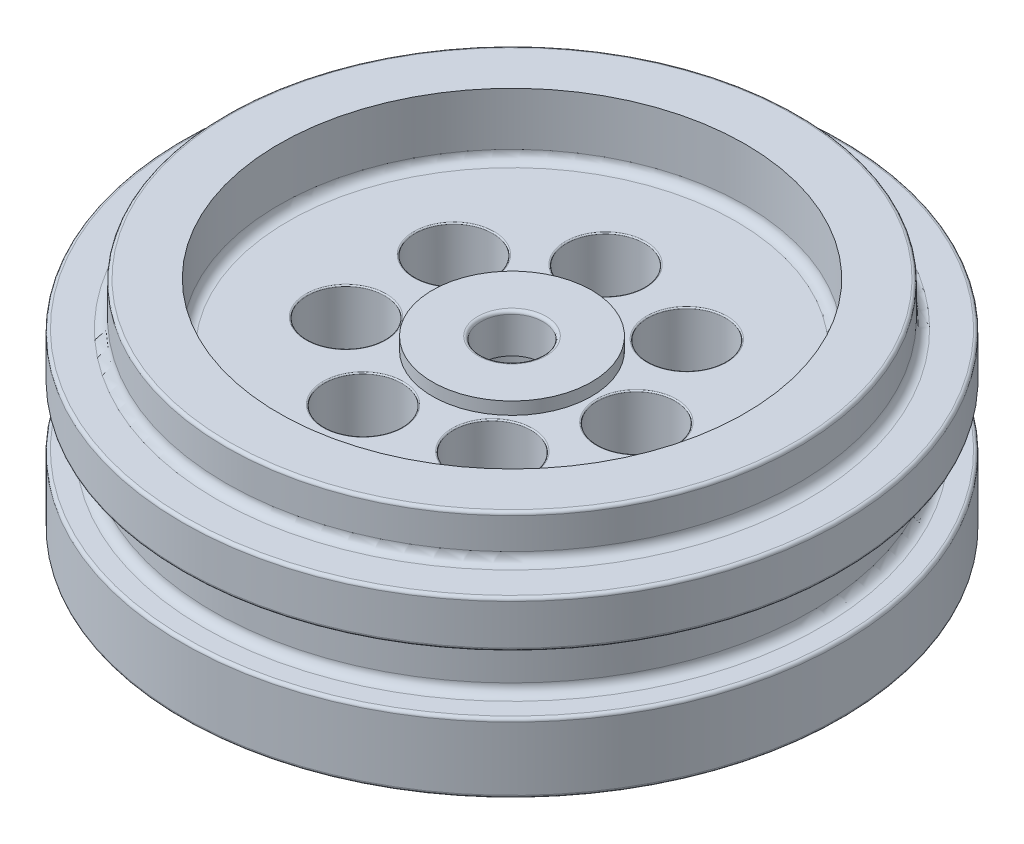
ISO-10303-21;
HEADER;
FILE_DESCRIPTION(('STEP AP214'),'2;1');
FILE_NAME('part.step','',(''),(''),'','','');
FILE_SCHEMA(('AUTOMOTIVE_DESIGN { 1 0 10303 214 1 1 1 1 }'));
ENDSEC;
DATA;
#1=APPLICATION_CONTEXT('core data for automotive mechanical design processes');
#2=APPLICATION_PROTOCOL_DEFINITION('international standard','automotive_design',2000,#1);
#3=PRODUCT_CONTEXT('',#1,'mechanical');
#4=PRODUCT('Part','Part','',(#3));
#5=PRODUCT_RELATED_PRODUCT_CATEGORY('part','',(#4));
#6=PRODUCT_DEFINITION_FORMATION('','',#4);
#7=PRODUCT_DEFINITION_CONTEXT('part definition',#1,'design');
#8=PRODUCT_DEFINITION('design','',#6,#7);
#9=PRODUCT_DEFINITION_SHAPE('','',#8);
#10=(LENGTH_UNIT() NAMED_UNIT(*) SI_UNIT(.MILLI.,.METRE.));
#11=(NAMED_UNIT(*) PLANE_ANGLE_UNIT() SI_UNIT($,.RADIAN.));
#12=(NAMED_UNIT(*) SI_UNIT($,.STERADIAN.) SOLID_ANGLE_UNIT());
#13=UNCERTAINTY_MEASURE_WITH_UNIT(LENGTH_MEASURE(1.E-05),#10,'distance_accuracy_value','');
#14=(GEOMETRIC_REPRESENTATION_CONTEXT(3) GLOBAL_UNCERTAINTY_ASSIGNED_CONTEXT((#13)) GLOBAL_UNIT_ASSIGNED_CONTEXT((#10,
#11,#12)) REPRESENTATION_CONTEXT('',''));
#15=CARTESIAN_POINT('',(0.,0.,0.));
#16=DIRECTION('',(0.,0.,1.));
#17=DIRECTION('',(1.,0.,0.));
#18=AXIS2_PLACEMENT_3D('',#15,#16,#17);
#19=CARTESIAN_POINT('',(0.,0.,0.));
#20=DIRECTION('',(0.,-1.,0.));
#21=DIRECTION('',(0.,0.,-1.));
#22=AXIS2_PLACEMENT_3D('',#19,#20,#21);
#23=CYLINDRICAL_SURFACE('',#22,13.462);
#24=CARTESIAN_POINT('',(0.,0.127,0.));
#25=DIRECTION('',(0.,-1.,0.));
#26=DIRECTION('',(0.,0.,-1.));
#27=AXIS2_PLACEMENT_3D('',#24,#25,#26);
#28=CIRCLE('',#27,13.462);
#29=CARTESIAN_POINT('',(0.,0.127,-13.462));
#30=VERTEX_POINT('',#29);
#31=EDGE_CURVE('E77',#30,#30,#28,.F.);
#32=ORIENTED_EDGE('',*,*,#31,.T.);
#33=EDGE_LOOP('',(#32));
#34=FACE_BOUND('',#33,.T.);
#35=CARTESIAN_POINT('',(0.,2.71527743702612,0.));
#36=DIRECTION('',(0.,-1.,0.));
#37=DIRECTION('',(0.,0.,-1.));
#38=AXIS2_PLACEMENT_3D('',#35,#36,#37);
#39=CIRCLE('',#38,13.462);
#40=CARTESIAN_POINT('',(0.,2.71527743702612,-13.462));
#41=VERTEX_POINT('',#40);
#42=EDGE_CURVE('E161',#41,#41,#39,.T.);
#43=ORIENTED_EDGE('',*,*,#42,.T.);
#44=EDGE_LOOP('',(#43));
#45=FACE_BOUND('',#44,.T.);
#46=ADVANCED_FACE('F50',(#34,#45),#23,.T.);
#47=CARTESIAN_POINT('',(0.,0.,0.));
#48=DIRECTION('',(0.,-1.,0.));
#49=DIRECTION('',(0.,0.,-1.));
#50=AXIS2_PLACEMENT_3D('',#47,#48,#49);
#51=PLANE('',#50);
#52=CARTESIAN_POINT('',(0.,0.,0.));
#53=DIRECTION('',(0.,-1.,0.));
#54=DIRECTION('',(0.,0.,-1.));
#55=AXIS2_PLACEMENT_3D('',#52,#53,#54);
#56=CIRCLE('',#55,9.5472661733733);
#57=CARTESIAN_POINT('',(0.,0.,-9.5472661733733));
#58=VERTEX_POINT('',#57);
#59=EDGE_CURVE('E201',#58,#58,#56,.T.);
#60=ORIENTED_EDGE('',*,*,#59,.T.);
#61=EDGE_LOOP('',(#60));
#62=FACE_BOUND('',#61,.T.);
#63=CARTESIAN_POINT('',(0.,0.,0.));
#64=DIRECTION('',(0.,1.,0.));
#65=DIRECTION('',(0.,0.,1.));
#66=AXIS2_PLACEMENT_3D('',#63,#64,#65);
#67=CIRCLE('',#66,6.985);
#68=CARTESIAN_POINT('',(0.,0.,6.985));
#69=VERTEX_POINT('',#68);
#70=EDGE_CURVE('E257',#69,#69,#67,.T.);
#71=ORIENTED_EDGE('',*,*,#70,.T.);
#72=EDGE_LOOP('',(#71));
#73=FACE_BOUND('',#72,.T.);
#74=ADVANCED_FACE('F321',(#62,#73),#51,.T.);
#75=CARTESIAN_POINT('',(0.,0.,0.));
#76=DIRECTION('',(0.,-1.,0.));
#77=DIRECTION('',(0.,0.,-1.));
#78=AXIS2_PLACEMENT_3D('',#75,#76,#77);
#79=CYLINDRICAL_SURFACE('',#78,11.684);
#80=CARTESIAN_POINT('',(0.,8.763,0.));
#81=DIRECTION('',(0.,1.,0.));
#82=DIRECTION('',(0.,0.,1.));
#83=AXIS2_PLACEMENT_3D('',#80,#81,#82);
#84=CIRCLE('',#83,11.684);
#85=CARTESIAN_POINT('',(0.,8.763,11.684));
#86=VERTEX_POINT('',#85);
#87=EDGE_CURVE('E71',#86,#86,#84,.F.);
#88=ORIENTED_EDGE('',*,*,#87,.T.);
#89=EDGE_LOOP('',(#88));
#90=FACE_BOUND('',#89,.T.);
#91=CARTESIAN_POINT('',(0.,7.493,0.));
#92=DIRECTION('',(0.,1.,0.));
#93=DIRECTION('',(0.,0.,1.));
#94=AXIS2_PLACEMENT_3D('',#91,#92,#93);
#95=CIRCLE('',#94,11.684);
#96=CARTESIAN_POINT('',(0.,7.493,11.684));
#97=VERTEX_POINT('',#96);
#98=EDGE_CURVE('E85',#97,#97,#95,.T.);
#99=ORIENTED_EDGE('',*,*,#98,.T.);
#100=EDGE_LOOP('',(#99));
#101=FACE_BOUND('',#100,.T.);
#102=ADVANCED_FACE('F329',(#90,#101),#79,.T.);
#103=CARTESIAN_POINT('',(11.684,8.89,0.));
#104=DIRECTION('',(0.,1.,0.));
#105=DIRECTION('',(0.,0.,1.));
#106=AXIS2_PLACEMENT_3D('',#103,#104,#105);
#107=PLANE('',#106);
#108=CARTESIAN_POINT('',(0.,8.89,0.));
#109=DIRECTION('',(0.,1.,0.));
#110=DIRECTION('',(0.,0.,1.));
#111=AXIS2_PLACEMENT_3D('',#108,#109,#110);
#112=CIRCLE('',#111,11.557);
#113=CARTESIAN_POINT('',(0.,8.89,11.557));
#114=VERTEX_POINT('',#113);
#115=EDGE_CURVE('E65',#114,#114,#112,.T.);
#116=ORIENTED_EDGE('',*,*,#115,.T.);
#117=EDGE_LOOP('',(#116));
#118=FACE_BOUND('',#117,.T.);
#119=CARTESIAN_POINT('',(0.,8.89,0.));
#120=DIRECTION('',(0.,-1.,0.));
#121=DIRECTION('',(0.,0.,-1.));
#122=AXIS2_PLACEMENT_3D('',#119,#120,#121);
#123=CIRCLE('',#122,9.525);
#124=CARTESIAN_POINT('',(0.,8.89,-9.525));
#125=VERTEX_POINT('',#124);
#126=EDGE_CURVE('E275',#125,#125,#123,.T.);
#127=ORIENTED_EDGE('',*,*,#126,.T.);
#128=EDGE_LOOP('',(#127));
#129=FACE_BOUND('',#128,.T.);
#130=ADVANCED_FACE('F338',(#118,#129),#107,.T.);
#131=CARTESIAN_POINT('',(0.,0.,0.));
#132=DIRECTION('',(0.,-1.,0.));
#133=DIRECTION('',(0.,0.,-1.));
#134=AXIS2_PLACEMENT_3D('',#131,#132,#133);
#135=CIRCLE('',#134,13.335);
#136=CARTESIAN_POINT('',(0.,0.,-13.335));
#137=VERTEX_POINT('',#136);
#138=EDGE_CURVE('E81',#137,#137,#135,.T.);
#139=ORIENTED_EDGE('',*,*,#138,.T.);
#140=EDGE_LOOP('',(#139));
#141=FACE_BOUND('',#140,.T.);
#142=CARTESIAN_POINT('',(0.,0.,0.));
#143=DIRECTION('',(0.,-1.,0.));
#144=DIRECTION('',(0.,0.,-1.));
#145=AXIS2_PLACEMENT_3D('',#142,#143,#144);
#146=CIRCLE('',#145,11.5208290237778);
#147=CARTESIAN_POINT('',(0.,0.,-11.5208290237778));
#148=VERTEX_POINT('',#147);
#149=EDGE_CURVE('E189',#148,#148,#146,.F.);
#150=ORIENTED_EDGE('',*,*,#149,.T.);
#151=EDGE_LOOP('',(#150));
#152=FACE_BOUND('',#151,.T.);
#153=ADVANCED_FACE('F332',(#141,#152),#51,.T.);
#154=CARTESIAN_POINT('',(0.,6.985,0.));
#155=DIRECTION('',(0.,1.,0.));
#156=DIRECTION('',(0.,0.,1.));
#157=AXIS2_PLACEMENT_3D('',#154,#155,#156);
#158=CIRCLE('',#157,13.462);
#159=CARTESIAN_POINT('',(0.,6.985,13.462));
#160=VERTEX_POINT('',#159);
#161=EDGE_CURVE('E58',#160,#160,#158,.F.);
#162=ORIENTED_EDGE('',*,*,#161,.T.);
#163=EDGE_LOOP('',(#162));
#164=FACE_BOUND('',#163,.T.);
#165=CARTESIAN_POINT('',(0.,5.33147743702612,0.));
#166=DIRECTION('',(0.,1.,0.));
#167=DIRECTION('',(0.,0.,1.));
#168=AXIS2_PLACEMENT_3D('',#165,#166,#167);
#169=CIRCLE('',#168,13.462);
#170=CARTESIAN_POINT('',(0.,5.33147743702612,13.462));
#171=VERTEX_POINT('',#170);
#172=EDGE_CURVE('E165',#171,#171,#169,.T.);
#173=ORIENTED_EDGE('',*,*,#172,.T.);
#174=EDGE_LOOP('',(#173));
#175=FACE_BOUND('',#174,.T.);
#176=ADVANCED_FACE('F317',(#164,#175),#23,.T.);
#177=CARTESIAN_POINT('',(13.462,7.112,0.));
#178=DIRECTION('',(0.,1.,0.));
#179=DIRECTION('',(0.,0.,1.));
#180=AXIS2_PLACEMENT_3D('',#177,#178,#179);
#181=PLANE('',#180);
#182=CARTESIAN_POINT('',(0.,7.112,0.));
#183=DIRECTION('',(0.,1.,0.));
#184=DIRECTION('',(0.,0.,1.));
#185=AXIS2_PLACEMENT_3D('',#182,#183,#184);
#186=CIRCLE('',#185,13.335);
#187=CARTESIAN_POINT('',(0.,7.112,13.335));
#188=VERTEX_POINT('',#187);
#189=EDGE_CURVE('E11',#188,#188,#186,.T.);
#190=ORIENTED_EDGE('',*,*,#189,.T.);
#191=EDGE_LOOP('',(#190));
#192=FACE_BOUND('',#191,.T.);
#193=CARTESIAN_POINT('',(0.,7.112,0.));
#194=DIRECTION('',(0.,1.,0.));
#195=DIRECTION('',(0.,0.,1.));
#196=AXIS2_PLACEMENT_3D('',#193,#194,#195);
#197=CIRCLE('',#196,12.065);
#198=CARTESIAN_POINT('',(0.,7.112,12.065));
#199=VERTEX_POINT('',#198);
#200=EDGE_CURVE('E89',#199,#199,#197,.F.);
#201=ORIENTED_EDGE('',*,*,#200,.T.);
#202=EDGE_LOOP('',(#201));
#203=FACE_BOUND('',#202,.T.);
#204=ADVANCED_FACE('F310',(#192,#203),#181,.T.);
#205=CARTESIAN_POINT('',(1.27,5.2578,0.));
#206=DIRECTION('',(0.,1.,0.));
#207=DIRECTION('',(0.,0.,1.));
#208=AXIS2_PLACEMENT_3D('',#205,#206,#207);
#209=PLANE('',#208);
#210=CARTESIAN_POINT('',(0.,5.2578,0.));
#211=DIRECTION('',(0.,-1.,0.));
#212=DIRECTION('',(0.,0.,-1.));
#213=AXIS2_PLACEMENT_3D('',#210,#211,#212);
#214=CIRCLE('',#213,1.27);
#215=CARTESIAN_POINT('',(0.,5.2578,-1.27));
#216=VERTEX_POINT('',#215);
#217=EDGE_CURVE('E267',#216,#216,#214,.T.);
#218=ORIENTED_EDGE('',*,*,#217,.F.);
#219=EDGE_LOOP('',(#218));
#220=FACE_BOUND('',#219,.T.);
#221=CARTESIAN_POINT('',(0.,5.2578,0.));
#222=DIRECTION('',(0.,-1.,0.));
#223=DIRECTION('',(0.,0.,-1.));
#224=AXIS2_PLACEMENT_3D('',#221,#222,#223);
#225=CIRCLE('',#224,2.159);
#226=CARTESIAN_POINT('',(0.,5.2578,-2.159));
#227=VERTEX_POINT('',#226);
#228=EDGE_CURVE('E228',#227,#227,#225,.T.);
#229=ORIENTED_EDGE('',*,*,#228,.T.);
#230=EDGE_LOOP('',(#229));
#231=FACE_BOUND('',#230,.T.);
#232=ADVANCED_FACE('F305',(#220,#231),#209,.F.);
#233=CARTESIAN_POINT('',(0.,0.,0.));
#234=DIRECTION('',(0.,-1.,0.));
#235=DIRECTION('',(0.,0.,-1.));
#236=AXIS2_PLACEMENT_3D('',#233,#234,#235);
#237=CYLINDRICAL_SURFACE('',#236,2.159);
#238=CARTESIAN_POINT('',(0.,2.54,0.));
#239=DIRECTION('',(0.,1.,0.));
#240=DIRECTION('',(0.,0.,1.));
#241=AXIS2_PLACEMENT_3D('',#238,#239,#240);
#242=CIRCLE('',#241,2.159);
#243=CARTESIAN_POINT('',(0.,2.54,2.159));
#244=VERTEX_POINT('',#243);
#245=EDGE_CURVE('E258',#244,#244,#242,.F.);
#246=ORIENTED_EDGE('',*,*,#245,.T.);
#247=EDGE_LOOP('',(#246));
#248=FACE_BOUND('',#247,.T.);
#249=ORIENTED_EDGE('',*,*,#228,.F.);
#250=EDGE_LOOP('',(#249));
#251=FACE_BOUND('',#250,.T.);
#252=ADVANCED_FACE('F301',(#248,#251),#237,.F.);
#253=CARTESIAN_POINT('',(1.27,6.858,0.));
#254=DIRECTION('',(0.,-1.,0.));
#255=DIRECTION('',(0.,0.,-1.));
#256=AXIS2_PLACEMENT_3D('',#253,#254,#255);
#257=PLANE('',#256);
#258=CARTESIAN_POINT('',(0.,6.858,0.));
#259=DIRECTION('',(0.,-1.,0.));
#260=DIRECTION('',(0.,0.,-1.));
#261=AXIS2_PLACEMENT_3D('',#258,#259,#260);
#262=CIRCLE('',#261,1.397);
#263=CARTESIAN_POINT('',(0.,6.858,-1.397));
#264=VERTEX_POINT('',#263);
#265=EDGE_CURVE('E225',#264,#264,#262,.T.);
#266=ORIENTED_EDGE('',*,*,#265,.T.);
#267=EDGE_LOOP('',(#266));
#268=FACE_BOUND('',#267,.T.);
#269=CARTESIAN_POINT('',(0.,6.858,0.));
#270=DIRECTION('',(0.,-1.,0.));
#271=DIRECTION('',(0.,0.,-1.));
#272=AXIS2_PLACEMENT_3D('',#269,#270,#271);
#273=CIRCLE('',#272,3.2512);
#274=CARTESIAN_POINT('',(0.,6.858,-3.2512));
#275=VERTEX_POINT('',#274);
#276=EDGE_CURVE('E271',#275,#275,#273,.F.);
#277=ORIENTED_EDGE('',*,*,#276,.T.);
#278=EDGE_LOOP('',(#277));
#279=FACE_BOUND('',#278,.T.);
#280=ADVANCED_FACE('F304',(#268,#279),#257,.F.);
#281=CARTESIAN_POINT('',(0.,0.,0.));
#282=DIRECTION('',(0.,-1.,0.));
#283=DIRECTION('',(0.,0.,-1.));
#284=AXIS2_PLACEMENT_3D('',#281,#282,#283);
#285=CYLINDRICAL_SURFACE('',#284,1.27);
#286=CARTESIAN_POINT('',(0.,6.731,0.));
#287=DIRECTION('',(0.,-1.,0.));
#288=DIRECTION('',(0.,0.,-1.));
#289=AXIS2_PLACEMENT_3D('',#286,#287,#288);
#290=CIRCLE('',#289,1.27);
#291=CARTESIAN_POINT('',(0.,6.731,-1.27));
#292=VERTEX_POINT('',#291);
#293=EDGE_CURVE('E221',#292,#292,#290,.F.);
#294=ORIENTED_EDGE('',*,*,#293,.T.);
#295=EDGE_LOOP('',(#294));
#296=FACE_BOUND('',#295,.T.);
#297=ORIENTED_EDGE('',*,*,#217,.T.);
#298=EDGE_LOOP('',(#297));
#299=FACE_BOUND('',#298,.T.);
#300=ADVANCED_FACE('F393',(#296,#299),#285,.F.);
#301=CARTESIAN_POINT('',(0.,0.,0.));
#302=DIRECTION('',(0.,-1.,0.));
#303=DIRECTION('',(0.,0.,-1.));
#304=AXIS2_PLACEMENT_3D('',#301,#302,#303);
#305=CYLINDRICAL_SURFACE('',#304,3.2512);
#306=CARTESIAN_POINT('',(0.,6.35,0.));
#307=DIRECTION('',(0.,-1.,0.));
#308=DIRECTION('',(0.,0.,-1.));
#309=AXIS2_PLACEMENT_3D('',#306,#307,#308);
#310=CIRCLE('',#309,3.2512);
#311=CARTESIAN_POINT('',(0.,6.35,-3.2512));
#312=VERTEX_POINT('',#311);
#313=EDGE_CURVE('E262',#312,#312,#310,.T.);
#314=ORIENTED_EDGE('',*,*,#313,.F.);
#315=EDGE_LOOP('',(#314));
#316=FACE_BOUND('',#315,.T.);
#317=ORIENTED_EDGE('',*,*,#276,.F.);
#318=EDGE_LOOP('',(#317));
#319=FACE_BOUND('',#318,.T.);
#320=ADVANCED_FACE('F390',(#316,#319),#305,.T.);
#321=CARTESIAN_POINT('',(3.2512,6.35,0.));
#322=DIRECTION('',(0.,-1.,0.));
#323=DIRECTION('',(0.,0.,-1.));
#324=AXIS2_PLACEMENT_3D('',#321,#322,#323);
#325=PLANE('',#324);
#326=CARTESIAN_POINT('',(0.,6.35,0.));
#327=DIRECTION('',(0.,-1.,0.));
#328=DIRECTION('',(0.,0.,-1.));
#329=AXIS2_PLACEMENT_3D('',#326,#327,#328);
#330=CIRCLE('',#329,9.144);
#331=CARTESIAN_POINT('',(0.,6.35,-9.144));
#332=VERTEX_POINT('',#331);
#333=EDGE_CURVE('E93',#332,#332,#330,.F.);
#334=ORIENTED_EDGE('',*,*,#333,.T.);
#335=EDGE_LOOP('',(#334));
#336=FACE_BOUND('',#335,.T.);
#337=CARTESIAN_POINT('',(5.08,6.35,0.));
#338=DIRECTION('',(0.,-1.,0.));
#339=DIRECTION('',(0.,0.,-1.));
#340=AXIS2_PLACEMENT_3D('',#337,#338,#339);
#341=CIRCLE('',#340,1.6383);
#342=CARTESIAN_POINT('',(5.08,6.35,-1.6383));
#343=VERTEX_POINT('',#342);
#344=EDGE_CURVE('E129',#343,#343,#341,.T.);
#345=ORIENTED_EDGE('',*,*,#344,.T.);
#346=EDGE_LOOP('',(#345));
#347=FACE_BOUND('',#346,.T.);
#348=CARTESIAN_POINT('',(3.16732819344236,6.35,3.9717039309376));
#349=DIRECTION('',(0.,-1.,0.));
#350=DIRECTION('',(0.,0.,-1.));
#351=AXIS2_PLACEMENT_3D('',#348,#349,#350);
#352=CIRCLE('',#351,1.6383);
#353=CARTESIAN_POINT('',(3.16732819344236,6.35,2.3334039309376));
#354=VERTEX_POINT('',#353);
#355=EDGE_CURVE('E133',#354,#354,#352,.T.);
#356=ORIENTED_EDGE('',*,*,#355,.T.);
#357=EDGE_LOOP('',(#356));
#358=FACE_BOUND('',#357,.T.);
#359=CARTESIAN_POINT('',(-1.1304063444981,6.35,4.95263379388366));
#360=DIRECTION('',(0.,-1.,0.));
#361=DIRECTION('',(0.,0.,-1.));
#362=AXIS2_PLACEMENT_3D('',#359,#360,#361);
#363=CIRCLE('',#362,1.6383);
#364=CARTESIAN_POINT('',(-1.1304063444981,6.35,3.31433379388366));
#365=VERTEX_POINT('',#364);
#366=EDGE_CURVE('E137',#365,#365,#363,.T.);
#367=ORIENTED_EDGE('',*,*,#366,.T.);
#368=EDGE_LOOP('',(#367));
#369=FACE_BOUND('',#368,.T.);
#370=CARTESIAN_POINT('',(-4.5769218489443,6.35,2.20412939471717));
#371=DIRECTION('',(0.,-1.,0.));
#372=DIRECTION('',(0.,0.,-1.));
#373=AXIS2_PLACEMENT_3D('',#370,#371,#372);
#374=CIRCLE('',#373,1.6383);
#375=CARTESIAN_POINT('',(-4.5769218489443,6.35,0.565829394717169));
#376=VERTEX_POINT('',#375);
#377=EDGE_CURVE('E141',#376,#376,#374,.T.);
#378=ORIENTED_EDGE('',*,*,#377,.T.);
#379=EDGE_LOOP('',(#378));
#380=FACE_BOUND('',#379,.T.);
#381=CARTESIAN_POINT('',(-4.57692184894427,6.35,-2.20412939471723));
#382=DIRECTION('',(0.,-1.,0.));
#383=DIRECTION('',(0.,0.,-1.));
#384=AXIS2_PLACEMENT_3D('',#381,#382,#383);
#385=CIRCLE('',#384,1.6383);
#386=CARTESIAN_POINT('',(-4.57692184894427,6.35,-3.84242939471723));
#387=VERTEX_POINT('',#386);
#388=EDGE_CURVE('E145',#387,#387,#385,.T.);
#389=ORIENTED_EDGE('',*,*,#388,.T.);
#390=EDGE_LOOP('',(#389));
#391=FACE_BOUND('',#390,.T.);
#392=CARTESIAN_POINT('',(-1.13040634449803,6.35,-4.95263379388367));
#393=DIRECTION('',(0.,-1.,0.));
#394=DIRECTION('',(0.,0.,-1.));
#395=AXIS2_PLACEMENT_3D('',#392,#393,#394);
#396=CIRCLE('',#395,1.6383);
#397=CARTESIAN_POINT('',(-1.13040634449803,6.35,-6.59093379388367));
#398=VERTEX_POINT('',#397);
#399=EDGE_CURVE('E149',#398,#398,#396,.T.);
#400=ORIENTED_EDGE('',*,*,#399,.T.);
#401=EDGE_LOOP('',(#400));
#402=FACE_BOUND('',#401,.T.);
#403=CARTESIAN_POINT('',(3.16732819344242,6.35,-3.97170393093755));
#404=DIRECTION('',(0.,-1.,0.));
#405=DIRECTION('',(0.,0.,-1.));
#406=AXIS2_PLACEMENT_3D('',#403,#404,#405);
#407=CIRCLE('',#406,1.6383);
#408=CARTESIAN_POINT('',(3.16732819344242,6.35,-5.61000393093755));
#409=VERTEX_POINT('',#408);
#410=EDGE_CURVE('E153',#409,#409,#407,.T.);
#411=ORIENTED_EDGE('',*,*,#410,.T.);
#412=EDGE_LOOP('',(#411));
#413=FACE_BOUND('',#412,.T.);
#414=ORIENTED_EDGE('',*,*,#313,.T.);
#415=EDGE_LOOP('',(#414));
#416=FACE_BOUND('',#415,.T.);
#417=ADVANCED_FACE('F392',(#336,#347,#358,#369,#380,#391,#402,#413,#416),#325,.F.);
#418=CARTESIAN_POINT('',(0.,0.,0.));
#419=DIRECTION('',(0.,-1.,0.));
#420=DIRECTION('',(0.,0.,-1.));
#421=AXIS2_PLACEMENT_3D('',#418,#419,#420);
#422=CYLINDRICAL_SURFACE('',#421,9.525);
#423=CARTESIAN_POINT('',(0.,6.731,0.));
#424=DIRECTION('',(0.,-1.,0.));
#425=DIRECTION('',(0.,0.,-1.));
#426=AXIS2_PLACEMENT_3D('',#423,#424,#425);
#427=CIRCLE('',#426,9.525);
#428=CARTESIAN_POINT('',(0.,6.731,-9.525));
#429=VERTEX_POINT('',#428);
#430=EDGE_CURVE('E97',#429,#429,#427,.T.);
#431=ORIENTED_EDGE('',*,*,#430,.T.);
#432=EDGE_LOOP('',(#431));
#433=FACE_BOUND('',#432,.T.);
#434=ORIENTED_EDGE('',*,*,#126,.F.);
#435=EDGE_LOOP('',(#434));
#436=FACE_BOUND('',#435,.T.);
#437=ADVANCED_FACE('F395',(#433,#436),#422,.F.);
#438=CARTESIAN_POINT('',(0.,1.3208,0.));
#439=DIRECTION('',(0.,-1.,0.));
#440=DIRECTION('',(0.,0.,-1.));
#441=AXIS2_PLACEMENT_3D('',#438,#439,#440);
#442=CONICAL_SURFACE('',#441,9.15477097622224,0.41887902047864);
#443=CARTESIAN_POINT('',(0.,0.178655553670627,0.));
#444=DIRECTION('',(0.,-1.,0.));
#445=DIRECTION('',(0.,0.,-1.));
#446=AXIS2_PLACEMENT_3D('',#443,#444,#445);
#447=CIRCLE('',#446,9.66328644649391);
#448=CARTESIAN_POINT('',(0.,0.178655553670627,-9.66328644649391));
#449=VERTEX_POINT('',#448);
#450=EDGE_CURVE('E197',#449,#449,#447,.F.);
#451=ORIENTED_EDGE('',*,*,#450,.T.);
#452=EDGE_LOOP('',(#451));
#453=FACE_BOUND('',#452,.T.);
#454=CARTESIAN_POINT('',(0.,0.784833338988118,0.));
#455=DIRECTION('',(0.,-1.,0.));
#456=DIRECTION('',(0.,0.,-1.));
#457=AXIS2_PLACEMENT_3D('',#454,#455,#456);
#458=CIRCLE('',#457,9.39339870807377);
#459=CARTESIAN_POINT('',(0.,0.784833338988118,-9.39339870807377));
#460=VERTEX_POINT('',#459);
#461=EDGE_CURVE('E217',#460,#460,#458,.T.);
#462=ORIENTED_EDGE('',*,*,#461,.T.);
#463=EDGE_LOOP('',(#462));
#464=FACE_BOUND('',#463,.T.);
#465=ADVANCED_FACE('F388',(#453,#464),#442,.T.);
#466=CARTESIAN_POINT('',(11.3938290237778,1.3208,0.));
#467=DIRECTION('',(0.,1.,0.));
#468=DIRECTION('',(0.,0.,1.));
#469=AXIS2_PLACEMENT_3D('',#466,#467,#468);
#470=PLANE('',#469);
#471=CARTESIAN_POINT('',(0.,1.3208,0.));
#472=DIRECTION('',(0.,1.,0.));
#473=DIRECTION('',(0.,0.,1.));
#474=AXIS2_PLACEMENT_3D('',#471,#472,#473);
#475=CIRCLE('',#474,9.7414595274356);
#476=CARTESIAN_POINT('',(0.,1.3208,9.7414595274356));
#477=VERTEX_POINT('',#476);
#478=EDGE_CURVE('E209',#477,#477,#475,.T.);
#479=ORIENTED_EDGE('',*,*,#478,.T.);
#480=EDGE_LOOP('',(#479));
#481=FACE_BOUND('',#480,.T.);
#482=CARTESIAN_POINT('',(0.,1.3208,0.));
#483=DIRECTION('',(0.,1.,0.));
#484=DIRECTION('',(0.,0.,1.));
#485=AXIS2_PLACEMENT_3D('',#482,#483,#484);
#486=CIRCLE('',#485,11.0128290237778);
#487=CARTESIAN_POINT('',(0.,1.3208,11.0128290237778));
#488=VERTEX_POINT('',#487);
#489=EDGE_CURVE('E213',#488,#488,#486,.F.);
#490=ORIENTED_EDGE('',*,*,#489,.T.);
#491=EDGE_LOOP('',(#490));
#492=FACE_BOUND('',#491,.T.);
#493=ADVANCED_FACE('F382',(#481,#492),#470,.F.);
#494=CARTESIAN_POINT('',(0.,0.,0.));
#495=DIRECTION('',(0.,-1.,0.));
#496=DIRECTION('',(0.,0.,-1.));
#497=AXIS2_PLACEMENT_3D('',#494,#495,#496);
#498=CYLINDRICAL_SURFACE('',#497,11.3938290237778);
#499=CARTESIAN_POINT('',(0.,0.127,0.));
#500=DIRECTION('',(0.,-1.,0.));
#501=DIRECTION('',(0.,0.,-1.));
#502=AXIS2_PLACEMENT_3D('',#499,#500,#501);
#503=CIRCLE('',#502,11.3938290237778);
#504=CARTESIAN_POINT('',(0.,0.127,-11.3938290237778));
#505=VERTEX_POINT('',#504);
#506=EDGE_CURVE('E193',#505,#505,#503,.T.);
#507=ORIENTED_EDGE('',*,*,#506,.T.);
#508=EDGE_LOOP('',(#507));
#509=FACE_BOUND('',#508,.T.);
#510=CARTESIAN_POINT('',(0.,0.9398,0.));
#511=DIRECTION('',(0.,1.,0.));
#512=DIRECTION('',(0.,0.,1.));
#513=AXIS2_PLACEMENT_3D('',#510,#511,#512);
#514=CIRCLE('',#513,11.3938290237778);
#515=CARTESIAN_POINT('',(0.,0.9398,11.3938290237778));
#516=VERTEX_POINT('',#515);
#517=EDGE_CURVE('E205',#516,#516,#514,.T.);
#518=ORIENTED_EDGE('',*,*,#517,.T.);
#519=EDGE_LOOP('',(#518));
#520=FACE_BOUND('',#519,.T.);
#521=ADVANCED_FACE('F376',(#509,#520),#498,.F.);
#522=CARTESIAN_POINT('',(13.462,2.84227743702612,0.));
#523=DIRECTION('',(0.,-1.,0.));
#524=DIRECTION('',(0.,0.,-1.));
#525=AXIS2_PLACEMENT_3D('',#522,#523,#524);
#526=PLANE('',#525);
#527=CARTESIAN_POINT('',(0.,2.84227743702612,0.));
#528=DIRECTION('',(0.,-1.,0.));
#529=DIRECTION('',(0.,0.,-1.));
#530=AXIS2_PLACEMENT_3D('',#527,#528,#529);
#531=CIRCLE('',#530,13.335);
#532=CARTESIAN_POINT('',(0.,2.84227743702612,-13.335));
#533=VERTEX_POINT('',#532);
#534=EDGE_CURVE('E157',#533,#533,#531,.F.);
#535=ORIENTED_EDGE('',*,*,#534,.T.);
#536=EDGE_LOOP('',(#535));
#537=FACE_BOUND('',#536,.T.);
#538=CARTESIAN_POINT('',(0.,2.84227743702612,0.));
#539=DIRECTION('',(0.,-1.,0.));
#540=DIRECTION('',(0.,0.,-1.));
#541=AXIS2_PLACEMENT_3D('',#538,#539,#540);
#542=CIRCLE('',#541,12.5984);
#543=CARTESIAN_POINT('',(0.,2.84227743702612,-12.5984));
#544=VERTEX_POINT('',#543);
#545=EDGE_CURVE('E173',#544,#544,#542,.T.);
#546=ORIENTED_EDGE('',*,*,#545,.T.);
#547=EDGE_LOOP('',(#546));
#548=FACE_BOUND('',#547,.T.);
#549=ADVANCED_FACE('F366',(#537,#548),#526,.F.);
#550=CARTESIAN_POINT('',(0.,0.,0.));
#551=DIRECTION('',(0.,-1.,0.));
#552=DIRECTION('',(0.,0.,-1.));
#553=AXIS2_PLACEMENT_3D('',#550,#551,#552);
#554=CYLINDRICAL_SURFACE('',#553,12.2174);
#555=CARTESIAN_POINT('',(0.,4.82347743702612,0.));
#556=DIRECTION('',(0.,1.,0.));
#557=DIRECTION('',(0.,0.,1.));
#558=AXIS2_PLACEMENT_3D('',#555,#556,#557);
#559=CIRCLE('',#558,12.2174);
#560=CARTESIAN_POINT('',(0.,4.82347743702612,12.2174));
#561=VERTEX_POINT('',#560);
#562=EDGE_CURVE('E181',#561,#561,#559,.F.);
#563=ORIENTED_EDGE('',*,*,#562,.T.);
#564=EDGE_LOOP('',(#563));
#565=FACE_BOUND('',#564,.T.);
#566=CARTESIAN_POINT('',(0.,3.22327743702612,0.));
#567=DIRECTION('',(0.,-1.,0.));
#568=DIRECTION('',(0.,0.,-1.));
#569=AXIS2_PLACEMENT_3D('',#566,#567,#568);
#570=CIRCLE('',#569,12.2174);
#571=CARTESIAN_POINT('',(0.,3.22327743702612,-12.2174));
#572=VERTEX_POINT('',#571);
#573=EDGE_CURVE('E185',#572,#572,#570,.F.);
#574=ORIENTED_EDGE('',*,*,#573,.T.);
#575=EDGE_LOOP('',(#574));
#576=FACE_BOUND('',#575,.T.);
#577=ADVANCED_FACE('F353',(#565,#576),#554,.T.);
#578=CARTESIAN_POINT('',(13.462,5.20447743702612,0.));
#579=DIRECTION('',(0.,1.,0.));
#580=DIRECTION('',(0.,0.,1.));
#581=AXIS2_PLACEMENT_3D('',#578,#579,#580);
#582=PLANE('',#581);
#583=CARTESIAN_POINT('',(0.,5.20447743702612,0.));
#584=DIRECTION('',(0.,1.,0.));
#585=DIRECTION('',(0.,0.,1.));
#586=AXIS2_PLACEMENT_3D('',#583,#584,#585);
#587=CIRCLE('',#586,13.335);
#588=CARTESIAN_POINT('',(0.,5.20447743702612,13.335));
#589=VERTEX_POINT('',#588);
#590=EDGE_CURVE('E169',#589,#589,#587,.F.);
#591=ORIENTED_EDGE('',*,*,#590,.T.);
#592=EDGE_LOOP('',(#591));
#593=FACE_BOUND('',#592,.T.);
#594=CARTESIAN_POINT('',(0.,5.20447743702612,0.));
#595=DIRECTION('',(0.,1.,0.));
#596=DIRECTION('',(0.,0.,1.));
#597=AXIS2_PLACEMENT_3D('',#594,#595,#596);
#598=CIRCLE('',#597,12.5984);
#599=CARTESIAN_POINT('',(0.,5.20447743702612,12.5984));
#600=VERTEX_POINT('',#599);
#601=EDGE_CURVE('E177',#600,#600,#598,.T.);
#602=ORIENTED_EDGE('',*,*,#601,.T.);
#603=EDGE_LOOP('',(#602));
#604=FACE_BOUND('',#603,.T.);
#605=ADVANCED_FACE('F296',(#593,#604),#582,.F.);
#606=CARTESIAN_POINT('',(0.,2.54,0.));
#607=DIRECTION('',(0.,1.,0.));
#608=DIRECTION('',(0.,0.,1.));
#609=AXIS2_PLACEMENT_3D('',#606,#607,#608);
#610=PLANE('',#609);
#611=CARTESIAN_POINT('',(3.16732819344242,2.54,-3.97170393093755));
#612=DIRECTION('',(0.,1.,0.));
#613=DIRECTION('',(0.,0.,1.));
#614=AXIS2_PLACEMENT_3D('',#611,#612,#613);
#615=CIRCLE('',#614,1.5875);
#616=CARTESIAN_POINT('',(3.16732819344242,2.54,-2.38420393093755));
#617=VERTEX_POINT('',#616);
#618=EDGE_CURVE('E229',#617,#617,#615,.T.);
#619=ORIENTED_EDGE('',*,*,#618,.T.);
#620=EDGE_LOOP('',(#619));
#621=FACE_BOUND('',#620,.T.);
#622=CARTESIAN_POINT('',(-1.13040634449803,2.54,-4.95263379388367));
#623=DIRECTION('',(0.,1.,0.));
#624=DIRECTION('',(0.,0.,1.));
#625=AXIS2_PLACEMENT_3D('',#622,#623,#624);
#626=CIRCLE('',#625,1.5875);
#627=CARTESIAN_POINT('',(-1.13040634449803,2.54,-3.36513379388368));
#628=VERTEX_POINT('',#627);
#629=EDGE_CURVE('E233',#628,#628,#626,.T.);
#630=ORIENTED_EDGE('',*,*,#629,.T.);
#631=EDGE_LOOP('',(#630));
#632=FACE_BOUND('',#631,.T.);
#633=CARTESIAN_POINT('',(-4.57692184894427,2.54,-2.20412939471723));
#634=DIRECTION('',(0.,1.,0.));
#635=DIRECTION('',(0.,0.,1.));
#636=AXIS2_PLACEMENT_3D('',#633,#634,#635);
#637=CIRCLE('',#636,1.5875);
#638=CARTESIAN_POINT('',(-4.57692184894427,2.54,-0.616629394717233));
#639=VERTEX_POINT('',#638);
#640=EDGE_CURVE('E237',#639,#639,#637,.T.);
#641=ORIENTED_EDGE('',*,*,#640,.T.);
#642=EDGE_LOOP('',(#641));
#643=FACE_BOUND('',#642,.T.);
#644=CARTESIAN_POINT('',(-4.5769218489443,2.54,2.20412939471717));
#645=DIRECTION('',(0.,1.,0.));
#646=DIRECTION('',(0.,0.,1.));
#647=AXIS2_PLACEMENT_3D('',#644,#645,#646);
#648=CIRCLE('',#647,1.5875);
#649=CARTESIAN_POINT('',(-4.5769218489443,2.54,3.79162939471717));
#650=VERTEX_POINT('',#649);
#651=EDGE_CURVE('E241',#650,#650,#648,.T.);
#652=ORIENTED_EDGE('',*,*,#651,.T.);
#653=EDGE_LOOP('',(#652));
#654=FACE_BOUND('',#653,.T.);
#655=CARTESIAN_POINT('',(-1.1304063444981,2.54,4.95263379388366));
#656=DIRECTION('',(0.,1.,0.));
#657=DIRECTION('',(0.,0.,1.));
#658=AXIS2_PLACEMENT_3D('',#655,#656,#657);
#659=CIRCLE('',#658,1.5875);
#660=CARTESIAN_POINT('',(-1.1304063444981,2.54,6.54013379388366));
#661=VERTEX_POINT('',#660);
#662=EDGE_CURVE('E245',#661,#661,#659,.T.);
#663=ORIENTED_EDGE('',*,*,#662,.T.);
#664=EDGE_LOOP('',(#663));
#665=FACE_BOUND('',#664,.T.);
#666=CARTESIAN_POINT('',(3.16732819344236,2.54,3.9717039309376));
#667=DIRECTION('',(0.,1.,0.));
#668=DIRECTION('',(0.,0.,1.));
#669=AXIS2_PLACEMENT_3D('',#666,#667,#668);
#670=CIRCLE('',#669,1.5875);
#671=CARTESIAN_POINT('',(3.16732819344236,2.54,5.5592039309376));
#672=VERTEX_POINT('',#671);
#673=EDGE_CURVE('E249',#672,#672,#670,.T.);
#674=ORIENTED_EDGE('',*,*,#673,.T.);
#675=EDGE_LOOP('',(#674));
#676=FACE_BOUND('',#675,.T.);
#677=CARTESIAN_POINT('',(5.08,2.54,0.));
#678=DIRECTION('',(0.,1.,0.));
#679=DIRECTION('',(0.,0.,1.));
#680=AXIS2_PLACEMENT_3D('',#677,#678,#679);
#681=CIRCLE('',#680,1.5875);
#682=CARTESIAN_POINT('',(5.08,2.54,1.5875));
#683=VERTEX_POINT('',#682);
#684=EDGE_CURVE('E253',#683,#683,#681,.T.);
#685=ORIENTED_EDGE('',*,*,#684,.T.);
#686=EDGE_LOOP('',(#685));
#687=FACE_BOUND('',#686,.T.);
#688=CARTESIAN_POINT('',(0.,2.54,0.));
#689=DIRECTION('',(0.,1.,0.));
#690=DIRECTION('',(0.,0.,1.));
#691=AXIS2_PLACEMENT_3D('',#688,#689,#690);
#692=CIRCLE('',#691,6.985);
#693=CARTESIAN_POINT('',(0.,2.54,6.985));
#694=VERTEX_POINT('',#693);
#695=EDGE_CURVE('E263',#694,#694,#692,.T.);
#696=ORIENTED_EDGE('',*,*,#695,.F.);
#697=EDGE_LOOP('',(#696));
#698=FACE_BOUND('',#697,.T.);
#699=ORIENTED_EDGE('',*,*,#245,.F.);
#700=EDGE_LOOP('',(#699));
#701=FACE_BOUND('',#700,.T.);
#702=ADVANCED_FACE('F293',(#621,#632,#643,#654,#665,#676,#687,#698,#701),#610,.F.);
#703=CARTESIAN_POINT('',(0.,2.54,0.));
#704=DIRECTION('',(0.,-1.,0.));
#705=DIRECTION('',(0.,0.,-1.));
#706=AXIS2_PLACEMENT_3D('',#703,#704,#705);
#707=CYLINDRICAL_SURFACE('',#706,6.985);
#708=ORIENTED_EDGE('',*,*,#695,.T.);
#709=EDGE_LOOP('',(#708));
#710=FACE_BOUND('',#709,.T.);
#711=ORIENTED_EDGE('',*,*,#70,.F.);
#712=EDGE_LOOP('',(#711));
#713=FACE_BOUND('',#712,.T.);
#714=ADVANCED_FACE('F290',(#710,#713),#707,.F.);
#715=CARTESIAN_POINT('',(5.08,0.,0.));
#716=DIRECTION('',(0.,-1.,0.));
#717=DIRECTION('',(0.,0.,-1.));
#718=AXIS2_PLACEMENT_3D('',#715,#716,#717);
#719=CYLINDRICAL_SURFACE('',#718,1.5875);
#720=CARTESIAN_POINT('',(5.08,6.2992,0.));
#721=DIRECTION('',(0.,-1.,0.));
#722=DIRECTION('',(0.,0.,-1.));
#723=AXIS2_PLACEMENT_3D('',#720,#721,#722);
#724=CIRCLE('',#723,1.5875);
#725=CARTESIAN_POINT('',(5.08,6.2992,-1.5875));
#726=VERTEX_POINT('',#725);
#727=EDGE_CURVE('E125',#726,#726,#724,.F.);
#728=ORIENTED_EDGE('',*,*,#727,.T.);
#729=EDGE_LOOP('',(#728));
#730=FACE_BOUND('',#729,.T.);
#731=ORIENTED_EDGE('',*,*,#684,.F.);
#732=EDGE_LOOP('',(#731));
#733=FACE_BOUND('',#732,.T.);
#734=ADVANCED_FACE('F625',(#730,#733),#719,.F.);
#735=CARTESIAN_POINT('',(3.16732819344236,0.,3.9717039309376));
#736=DIRECTION('',(0.,-1.,0.));
#737=DIRECTION('',(0.,0.,-1.));
#738=AXIS2_PLACEMENT_3D('',#735,#736,#737);
#739=CYLINDRICAL_SURFACE('',#738,1.5875);
#740=CARTESIAN_POINT('',(3.16732819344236,6.2992,3.9717039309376));
#741=DIRECTION('',(0.,-1.,0.));
#742=DIRECTION('',(0.,0.,-1.));
#743=AXIS2_PLACEMENT_3D('',#740,#741,#742);
#744=CIRCLE('',#743,1.5875);
#745=CARTESIAN_POINT('',(3.16732819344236,6.2992,2.3842039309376));
#746=VERTEX_POINT('',#745);
#747=EDGE_CURVE('E121',#746,#746,#744,.F.);
#748=ORIENTED_EDGE('',*,*,#747,.T.);
#749=EDGE_LOOP('',(#748));
#750=FACE_BOUND('',#749,.T.);
#751=ORIENTED_EDGE('',*,*,#673,.F.);
#752=EDGE_LOOP('',(#751));
#753=FACE_BOUND('',#752,.T.);
#754=ADVANCED_FACE('F634',(#750,#753),#739,.F.);
#755=CARTESIAN_POINT('',(-1.1304063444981,0.,4.95263379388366));
#756=DIRECTION('',(0.,-1.,0.));
#757=DIRECTION('',(0.,0.,-1.));
#758=AXIS2_PLACEMENT_3D('',#755,#756,#757);
#759=CYLINDRICAL_SURFACE('',#758,1.5875);
#760=CARTESIAN_POINT('',(-1.1304063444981,6.2992,4.95263379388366));
#761=DIRECTION('',(0.,-1.,0.));
#762=DIRECTION('',(0.,0.,-1.));
#763=AXIS2_PLACEMENT_3D('',#760,#761,#762);
#764=CIRCLE('',#763,1.5875);
#765=CARTESIAN_POINT('',(-1.1304063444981,6.2992,3.36513379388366));
#766=VERTEX_POINT('',#765);
#767=EDGE_CURVE('E117',#766,#766,#764,.F.);
#768=ORIENTED_EDGE('',*,*,#767,.T.);
#769=EDGE_LOOP('',(#768));
#770=FACE_BOUND('',#769,.T.);
#771=ORIENTED_EDGE('',*,*,#662,.F.);
#772=EDGE_LOOP('',(#771));
#773=FACE_BOUND('',#772,.T.);
#774=ADVANCED_FACE('F644',(#770,#773),#759,.F.);
#775=CARTESIAN_POINT('',(-4.5769218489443,0.,2.20412939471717));
#776=DIRECTION('',(0.,-1.,0.));
#777=DIRECTION('',(0.,0.,-1.));
#778=AXIS2_PLACEMENT_3D('',#775,#776,#777);
#779=CYLINDRICAL_SURFACE('',#778,1.5875);
#780=CARTESIAN_POINT('',(-4.5769218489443,6.2992,2.20412939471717));
#781=DIRECTION('',(0.,-1.,0.));
#782=DIRECTION('',(0.,0.,-1.));
#783=AXIS2_PLACEMENT_3D('',#780,#781,#782);
#784=CIRCLE('',#783,1.5875);
#785=CARTESIAN_POINT('',(-4.5769218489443,6.2992,0.616629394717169));
#786=VERTEX_POINT('',#785);
#787=EDGE_CURVE('E113',#786,#786,#784,.F.);
#788=ORIENTED_EDGE('',*,*,#787,.T.);
#789=EDGE_LOOP('',(#788));
#790=FACE_BOUND('',#789,.T.);
#791=ORIENTED_EDGE('',*,*,#651,.F.);
#792=EDGE_LOOP('',(#791));
#793=FACE_BOUND('',#792,.T.);
#794=ADVANCED_FACE('F654',(#790,#793),#779,.F.);
#795=CARTESIAN_POINT('',(-4.57692184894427,0.,-2.20412939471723));
#796=DIRECTION('',(0.,-1.,0.));
#797=DIRECTION('',(0.,0.,-1.));
#798=AXIS2_PLACEMENT_3D('',#795,#796,#797);
#799=CYLINDRICAL_SURFACE('',#798,1.5875);
#800=CARTESIAN_POINT('',(-4.57692184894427,6.2992,-2.20412939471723));
#801=DIRECTION('',(0.,-1.,0.));
#802=DIRECTION('',(0.,0.,-1.));
#803=AXIS2_PLACEMENT_3D('',#800,#801,#802);
#804=CIRCLE('',#803,1.5875);
#805=CARTESIAN_POINT('',(-4.57692184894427,6.2992,-3.79162939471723));
#806=VERTEX_POINT('',#805);
#807=EDGE_CURVE('E109',#806,#806,#804,.F.);
#808=ORIENTED_EDGE('',*,*,#807,.T.);
#809=EDGE_LOOP('',(#808));
#810=FACE_BOUND('',#809,.T.);
#811=ORIENTED_EDGE('',*,*,#640,.F.);
#812=EDGE_LOOP('',(#811));
#813=FACE_BOUND('',#812,.T.);
#814=ADVANCED_FACE('F664',(#810,#813),#799,.F.);
#815=CARTESIAN_POINT('',(-1.13040634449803,0.,-4.95263379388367));
#816=DIRECTION('',(0.,-1.,0.));
#817=DIRECTION('',(0.,0.,-1.));
#818=AXIS2_PLACEMENT_3D('',#815,#816,#817);
#819=CYLINDRICAL_SURFACE('',#818,1.5875);
#820=CARTESIAN_POINT('',(-1.13040634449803,6.2992,-4.95263379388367));
#821=DIRECTION('',(0.,-1.,0.));
#822=DIRECTION('',(0.,0.,-1.));
#823=AXIS2_PLACEMENT_3D('',#820,#821,#822);
#824=CIRCLE('',#823,1.5875);
#825=CARTESIAN_POINT('',(-1.13040634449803,6.2992,-6.54013379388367));
#826=VERTEX_POINT('',#825);
#827=EDGE_CURVE('E105',#826,#826,#824,.F.);
#828=ORIENTED_EDGE('',*,*,#827,.T.);
#829=EDGE_LOOP('',(#828));
#830=FACE_BOUND('',#829,.T.);
#831=ORIENTED_EDGE('',*,*,#629,.F.);
#832=EDGE_LOOP('',(#831));
#833=FACE_BOUND('',#832,.T.);
#834=ADVANCED_FACE('F427',(#830,#833),#819,.F.);
#835=CARTESIAN_POINT('',(3.16732819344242,0.,-3.97170393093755));
#836=DIRECTION('',(0.,-1.,0.));
#837=DIRECTION('',(0.,0.,-1.));
#838=AXIS2_PLACEMENT_3D('',#835,#836,#837);
#839=CYLINDRICAL_SURFACE('',#838,1.5875);
#840=CARTESIAN_POINT('',(3.16732819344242,6.2992,-3.97170393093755));
#841=DIRECTION('',(0.,-1.,0.));
#842=DIRECTION('',(0.,0.,-1.));
#843=AXIS2_PLACEMENT_3D('',#840,#841,#842);
#844=CIRCLE('',#843,1.5875);
#845=CARTESIAN_POINT('',(3.16732819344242,6.2992,-5.55920393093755));
#846=VERTEX_POINT('',#845);
#847=EDGE_CURVE('E101',#846,#846,#844,.F.);
#848=ORIENTED_EDGE('',*,*,#847,.T.);
#849=EDGE_LOOP('',(#848));
#850=FACE_BOUND('',#849,.T.);
#851=ORIENTED_EDGE('',*,*,#618,.F.);
#852=EDGE_LOOP('',(#851));
#853=FACE_BOUND('',#852,.T.);
#854=ADVANCED_FACE('F417',(#850,#853),#839,.F.);
#855=CARTESIAN_POINT('',(0.,6.731,0.));
#856=DIRECTION('',(0.,-1.,0.));
#857=DIRECTION('',(0.,0.,-1.));
#858=AXIS2_PLACEMENT_3D('',#855,#856,#857);
#859=TOROIDAL_SURFACE('',#858,1.397,0.127);
#860=ORIENTED_EDGE('',*,*,#293,.F.);
#861=EDGE_LOOP('',(#860));
#862=FACE_BOUND('',#861,.T.);
#863=ORIENTED_EDGE('',*,*,#265,.F.);
#864=EDGE_LOOP('',(#863));
#865=FACE_BOUND('',#864,.T.);
#866=ADVANCED_FACE('F414',(#862,#865),#859,.T.);
#867=CARTESIAN_POINT('',(0.,0.9398,0.));
#868=DIRECTION('',(0.,1.,0.));
#869=DIRECTION('',(0.,0.,1.));
#870=AXIS2_PLACEMENT_3D('',#867,#868,#869);
#871=TOROIDAL_SURFACE('',#870,9.7414595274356,0.381);
#872=ORIENTED_EDGE('',*,*,#478,.F.);
#873=EDGE_LOOP('',(#872));
#874=FACE_BOUND('',#873,.T.);
#875=ORIENTED_EDGE('',*,*,#461,.F.);
#876=EDGE_LOOP('',(#875));
#877=FACE_BOUND('',#876,.T.);
#878=ADVANCED_FACE('F416',(#874,#877),#871,.F.);
#879=CARTESIAN_POINT('',(0.,0.9398,0.));
#880=DIRECTION('',(0.,1.,0.));
#881=DIRECTION('',(0.,0.,1.));
#882=AXIS2_PLACEMENT_3D('',#879,#880,#881);
#883=TOROIDAL_SURFACE('',#882,11.0128290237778,0.381);
#884=ORIENTED_EDGE('',*,*,#517,.F.);
#885=EDGE_LOOP('',(#884));
#886=FACE_BOUND('',#885,.T.);
#887=ORIENTED_EDGE('',*,*,#489,.F.);
#888=EDGE_LOOP('',(#887));
#889=FACE_BOUND('',#888,.T.);
#890=ADVANCED_FACE('F423',(#886,#889),#883,.F.);
#891=CARTESIAN_POINT('',(0.,0.127,0.));
#892=DIRECTION('',(0.,-1.,0.));
#893=DIRECTION('',(0.,0.,-1.));
#894=AXIS2_PLACEMENT_3D('',#891,#892,#893);
#895=TOROIDAL_SURFACE('',#894,9.5472661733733,0.127);
#896=ORIENTED_EDGE('',*,*,#450,.F.);
#897=EDGE_LOOP('',(#896));
#898=FACE_BOUND('',#897,.T.);
#899=ORIENTED_EDGE('',*,*,#59,.F.);
#900=EDGE_LOOP('',(#899));
#901=FACE_BOUND('',#900,.T.);
#902=ADVANCED_FACE('F439',(#898,#901),#895,.T.);
#903=CARTESIAN_POINT('',(0.,0.127,0.));
#904=DIRECTION('',(0.,-1.,0.));
#905=DIRECTION('',(0.,0.,-1.));
#906=AXIS2_PLACEMENT_3D('',#903,#904,#905);
#907=TOROIDAL_SURFACE('',#906,11.5208290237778,0.127);
#908=ORIENTED_EDGE('',*,*,#149,.F.);
#909=EDGE_LOOP('',(#908));
#910=FACE_BOUND('',#909,.T.);
#911=ORIENTED_EDGE('',*,*,#506,.F.);
#912=EDGE_LOOP('',(#911));
#913=FACE_BOUND('',#912,.T.);
#914=ADVANCED_FACE('F360',(#910,#913),#907,.T.);
#915=CARTESIAN_POINT('',(0.,4.82347743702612,0.));
#916=DIRECTION('',(0.,1.,0.));
#917=DIRECTION('',(0.,0.,1.));
#918=AXIS2_PLACEMENT_3D('',#915,#916,#917);
#919=TOROIDAL_SURFACE('',#918,12.5984,0.381);
#920=ORIENTED_EDGE('',*,*,#601,.F.);
#921=EDGE_LOOP('',(#920));
#922=FACE_BOUND('',#921,.T.);
#923=ORIENTED_EDGE('',*,*,#562,.F.);
#924=EDGE_LOOP('',(#923));
#925=FACE_BOUND('',#924,.T.);
#926=ADVANCED_FACE('F357',(#922,#925),#919,.F.);
#927=CARTESIAN_POINT('',(0.,3.22327743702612,0.));
#928=DIRECTION('',(0.,-1.,0.));
#929=DIRECTION('',(0.,0.,-1.));
#930=AXIS2_PLACEMENT_3D('',#927,#928,#929);
#931=TOROIDAL_SURFACE('',#930,12.5984,0.381);
#932=ORIENTED_EDGE('',*,*,#573,.F.);
#933=EDGE_LOOP('',(#932));
#934=FACE_BOUND('',#933,.T.);
#935=ORIENTED_EDGE('',*,*,#545,.F.);
#936=EDGE_LOOP('',(#935));
#937=FACE_BOUND('',#936,.T.);
#938=ADVANCED_FACE('F347',(#934,#937),#931,.F.);
#939=CARTESIAN_POINT('',(0.,5.33147743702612,0.));
#940=DIRECTION('',(0.,1.,0.));
#941=DIRECTION('',(0.,0.,1.));
#942=AXIS2_PLACEMENT_3D('',#939,#940,#941);
#943=TOROIDAL_SURFACE('',#942,13.335,0.127);
#944=ORIENTED_EDGE('',*,*,#172,.F.);
#945=EDGE_LOOP('',(#944));
#946=FACE_BOUND('',#945,.T.);
#947=ORIENTED_EDGE('',*,*,#590,.F.);
#948=EDGE_LOOP('',(#947));
#949=FACE_BOUND('',#948,.T.);
#950=ADVANCED_FACE('F343',(#946,#949),#943,.T.);
#951=CARTESIAN_POINT('',(0.,2.71527743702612,0.));
#952=DIRECTION('',(0.,-1.,0.));
#953=DIRECTION('',(0.,0.,-1.));
#954=AXIS2_PLACEMENT_3D('',#951,#952,#953);
#955=TOROIDAL_SURFACE('',#954,13.335,0.127);
#956=ORIENTED_EDGE('',*,*,#534,.F.);
#957=EDGE_LOOP('',(#956));
#958=FACE_BOUND('',#957,.T.);
#959=ORIENTED_EDGE('',*,*,#42,.F.);
#960=EDGE_LOOP('',(#959));
#961=FACE_BOUND('',#960,.T.);
#962=ADVANCED_FACE('F346',(#958,#961),#955,.T.);
#963=CARTESIAN_POINT('',(5.08,6.2992,0.));
#964=DIRECTION('',(0.,-1.,0.));
#965=DIRECTION('',(0.,0.,-1.));
#966=AXIS2_PLACEMENT_3D('',#963,#964,#965);
#967=TOROIDAL_SURFACE('',#966,1.6383,0.0508);
#968=ORIENTED_EDGE('',*,*,#727,.F.);
#969=EDGE_LOOP('',(#968));
#970=FACE_BOUND('',#969,.T.);
#971=ORIENTED_EDGE('',*,*,#344,.F.);
#972=EDGE_LOOP('',(#971));
#973=FACE_BOUND('',#972,.T.);
#974=ADVANCED_FACE('F449',(#970,#973),#967,.T.);
#975=CARTESIAN_POINT('',(3.16732819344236,6.2992,3.9717039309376));
#976=DIRECTION('',(0.,-1.,0.));
#977=DIRECTION('',(0.,0.,-1.));
#978=AXIS2_PLACEMENT_3D('',#975,#976,#977);
#979=TOROIDAL_SURFACE('',#978,1.6383,0.0508);
#980=ORIENTED_EDGE('',*,*,#747,.F.);
#981=EDGE_LOOP('',(#980));
#982=FACE_BOUND('',#981,.T.);
#983=ORIENTED_EDGE('',*,*,#355,.F.);
#984=EDGE_LOOP('',(#983));
#985=FACE_BOUND('',#984,.T.);
#986=ADVANCED_FACE('F453',(#982,#985),#979,.T.);
#987=CARTESIAN_POINT('',(-1.1304063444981,6.2992,4.95263379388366));
#988=DIRECTION('',(0.,-1.,0.));
#989=DIRECTION('',(0.,0.,-1.));
#990=AXIS2_PLACEMENT_3D('',#987,#988,#989);
#991=TOROIDAL_SURFACE('',#990,1.6383,0.0508);
#992=ORIENTED_EDGE('',*,*,#767,.F.);
#993=EDGE_LOOP('',(#992));
#994=FACE_BOUND('',#993,.T.);
#995=ORIENTED_EDGE('',*,*,#366,.F.);
#996=EDGE_LOOP('',(#995));
#997=FACE_BOUND('',#996,.T.);
#998=ADVANCED_FACE('F457',(#994,#997),#991,.T.);
#999=CARTESIAN_POINT('',(-4.5769218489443,6.2992,2.20412939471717));
#1000=DIRECTION('',(0.,-1.,0.));
#1001=DIRECTION('',(0.,0.,-1.));
#1002=AXIS2_PLACEMENT_3D('',#999,#1000,#1001);
#1003=TOROIDAL_SURFACE('',#1002,1.6383,0.0508);
#1004=ORIENTED_EDGE('',*,*,#787,.F.);
#1005=EDGE_LOOP('',(#1004));
#1006=FACE_BOUND('',#1005,.T.);
#1007=ORIENTED_EDGE('',*,*,#377,.F.);
#1008=EDGE_LOOP('',(#1007));
#1009=FACE_BOUND('',#1008,.T.);
#1010=ADVANCED_FACE('F461',(#1006,#1009),#1003,.T.);
#1011=CARTESIAN_POINT('',(-4.57692184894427,6.2992,-2.20412939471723));
#1012=DIRECTION('',(0.,-1.,0.));
#1013=DIRECTION('',(0.,0.,-1.));
#1014=AXIS2_PLACEMENT_3D('',#1011,#1012,#1013);
#1015=TOROIDAL_SURFACE('',#1014,1.6383,0.0508);
#1016=ORIENTED_EDGE('',*,*,#807,.F.);
#1017=EDGE_LOOP('',(#1016));
#1018=FACE_BOUND('',#1017,.T.);
#1019=ORIENTED_EDGE('',*,*,#388,.F.);
#1020=EDGE_LOOP('',(#1019));
#1021=FACE_BOUND('',#1020,.T.);
#1022=ADVANCED_FACE('F465',(#1018,#1021),#1015,.T.);
#1023=CARTESIAN_POINT('',(-1.13040634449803,6.2992,-4.95263379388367));
#1024=DIRECTION('',(0.,-1.,0.));
#1025=DIRECTION('',(0.,0.,-1.));
#1026=AXIS2_PLACEMENT_3D('',#1023,#1024,#1025);
#1027=TOROIDAL_SURFACE('',#1026,1.6383,0.0508);
#1028=ORIENTED_EDGE('',*,*,#827,.F.);
#1029=EDGE_LOOP('',(#1028));
#1030=FACE_BOUND('',#1029,.T.);
#1031=ORIENTED_EDGE('',*,*,#399,.F.);
#1032=EDGE_LOOP('',(#1031));
#1033=FACE_BOUND('',#1032,.T.);
#1034=ADVANCED_FACE('F469',(#1030,#1033),#1027,.T.);
#1035=CARTESIAN_POINT('',(3.16732819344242,6.2992,-3.97170393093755));
#1036=DIRECTION('',(0.,-1.,0.));
#1037=DIRECTION('',(0.,0.,-1.));
#1038=AXIS2_PLACEMENT_3D('',#1035,#1036,#1037);
#1039=TOROIDAL_SURFACE('',#1038,1.6383,0.0508);
#1040=ORIENTED_EDGE('',*,*,#847,.F.);
#1041=EDGE_LOOP('',(#1040));
#1042=FACE_BOUND('',#1041,.T.);
#1043=ORIENTED_EDGE('',*,*,#410,.F.);
#1044=EDGE_LOOP('',(#1043));
#1045=FACE_BOUND('',#1044,.T.);
#1046=ADVANCED_FACE('F473',(#1042,#1045),#1039,.T.);
#1047=CARTESIAN_POINT('',(0.,6.731,0.));
#1048=DIRECTION('',(0.,-1.,0.));
#1049=DIRECTION('',(0.,0.,-1.));
#1050=AXIS2_PLACEMENT_3D('',#1047,#1048,#1049);
#1051=TOROIDAL_SURFACE('',#1050,9.144,0.381);
#1052=ORIENTED_EDGE('',*,*,#333,.F.);
#1053=EDGE_LOOP('',(#1052));
#1054=FACE_BOUND('',#1053,.T.);
#1055=ORIENTED_EDGE('',*,*,#430,.F.);
#1056=EDGE_LOOP('',(#1055));
#1057=FACE_BOUND('',#1056,.T.);
#1058=ADVANCED_FACE('F477',(#1054,#1057),#1051,.F.);
#1059=CARTESIAN_POINT('',(0.,7.493,0.));
#1060=DIRECTION('',(0.,1.,0.));
#1061=DIRECTION('',(0.,0.,1.));
#1062=AXIS2_PLACEMENT_3D('',#1059,#1060,#1061);
#1063=TOROIDAL_SURFACE('',#1062,12.065,0.381);
#1064=ORIENTED_EDGE('',*,*,#98,.F.);
#1065=EDGE_LOOP('',(#1064));
#1066=FACE_BOUND('',#1065,.T.);
#1067=ORIENTED_EDGE('',*,*,#200,.F.);
#1068=EDGE_LOOP('',(#1067));
#1069=FACE_BOUND('',#1068,.T.);
#1070=ADVANCED_FACE('F481',(#1066,#1069),#1063,.F.);
#1071=CARTESIAN_POINT('',(0.,0.127,0.));
#1072=DIRECTION('',(0.,-1.,0.));
#1073=DIRECTION('',(0.,0.,-1.));
#1074=AXIS2_PLACEMENT_3D('',#1071,#1072,#1073);
#1075=TOROIDAL_SURFACE('',#1074,13.335,0.127);
#1076=ORIENTED_EDGE('',*,*,#31,.F.);
#1077=EDGE_LOOP('',(#1076));
#1078=FACE_BOUND('',#1077,.T.);
#1079=ORIENTED_EDGE('',*,*,#138,.F.);
#1080=EDGE_LOOP('',(#1079));
#1081=FACE_BOUND('',#1080,.T.);
#1082=ADVANCED_FACE('F484',(#1078,#1081),#1075,.T.);
#1083=CARTESIAN_POINT('',(0.,8.763,0.));
#1084=DIRECTION('',(0.,1.,0.));
#1085=DIRECTION('',(0.,0.,1.));
#1086=AXIS2_PLACEMENT_3D('',#1083,#1084,#1085);
#1087=TOROIDAL_SURFACE('',#1086,11.557,0.127);
#1088=ORIENTED_EDGE('',*,*,#115,.F.);
#1089=EDGE_LOOP('',(#1088));
#1090=FACE_BOUND('',#1089,.T.);
#1091=ORIENTED_EDGE('',*,*,#87,.F.);
#1092=EDGE_LOOP('',(#1091));
#1093=FACE_BOUND('',#1092,.T.);
#1094=ADVANCED_FACE('F487',(#1090,#1093),#1087,.T.);
#1095=CARTESIAN_POINT('',(0.,6.985,0.));
#1096=DIRECTION('',(0.,1.,0.));
#1097=DIRECTION('',(0.,0.,1.));
#1098=AXIS2_PLACEMENT_3D('',#1095,#1096,#1097);
#1099=TOROIDAL_SURFACE('',#1098,13.335,0.127);
#1100=ORIENTED_EDGE('',*,*,#189,.F.);
#1101=EDGE_LOOP('',(#1100));
#1102=FACE_BOUND('',#1101,.T.);
#1103=ORIENTED_EDGE('',*,*,#161,.F.);
#1104=EDGE_LOOP('',(#1103));
#1105=FACE_BOUND('',#1104,.T.);
#1106=ADVANCED_FACE('F52',(#1102,#1105),#1099,.T.);
#1107=CLOSED_SHELL('',(#46,#74,#102,#130,#153,#176,#204,#232,#252,#280,#300,#320,#417,#437,#465,
#493,#521,#549,#577,#605,#702,#714,#734,#754,#774,#794,#814,#834,#854,#866,#878,#890,#902,#914,
#926,#938,#950,#962,#974,#986,#998,#1010,#1022,#1034,#1046,#1058,#1070,#1082,#1094,#1106));
#1108=MANIFOLD_SOLID_BREP('B2',#1107);
#1109=ADVANCED_BREP_SHAPE_REPRESENTATION('',(#18,#1108),#14);
#1110=SHAPE_DEFINITION_REPRESENTATION(#9,#1109);
ENDSEC;
END-ISO-10303-21;
